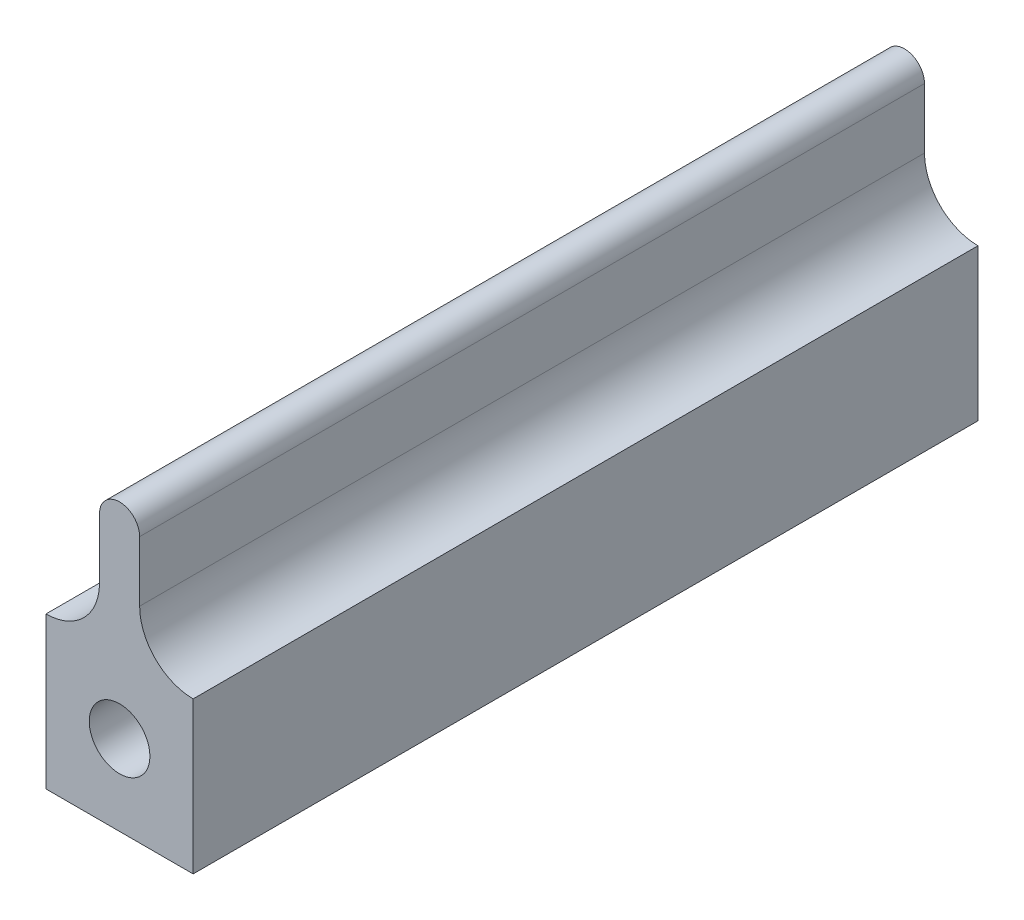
from build123d import *

# Parameters (mm, degrees)
BASE_EXTRUSION_DEPTH       = 88
TROU_TARAUD_M8X1_251_D     = 6.8
TROU_TARAUD_M8X1_251_DEPTH = 30
TROU_TARAUD_M8X1_251_TIP   = 2.042926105


with BuildPart() as part:
    # Esquisse1 → Base-Extrusion (new body)
    with BuildSketch(Plane.XY):
        with BuildLine():
            Line((-135.75, -171.5), (-119.25, -171.5))
            Line((-119.25, -171.5), (-119.25, -154.5))
            ThreePointArc((-119.25, -154.5), (-123.492640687, -152.742640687), (-125.25, -148.5))
            Line((-125.25, -148.5), (-125.25, -141.75))
            ThreePointArc((-125.25, -141.75), (-127.5, -139.5), (-129.75, -141.75))
            Line((-129.75, -141.75), (-129.75, -148.5))
            ThreePointArc((-129.75, -148.5), (-131.507359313, -152.742640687), (-135.75, -154.5))
            Line((-135.75, -154.5), (-135.75, -171.5))
        make_face()
    extrude(amount=-BASE_EXTRUSION_DEPTH)

    # Trou taraud_ M8x1.251
    with Locations(Plane.XY):
        with Locations((-127.5, -162.5)):
            Hole(TROU_TARAUD_M8X1_251_D / 2, depth=TROU_TARAUD_M8X1_251_DEPTH)
            with Locations((0, 0, -(TROU_TARAUD_M8X1_251_DEPTH + TROU_TARAUD_M8X1_251_TIP / 2))):  # 118° drill point
                Cone(0, TROU_TARAUD_M8X1_251_D / 2, TROU_TARAUD_M8X1_251_TIP, mode=Mode.SUBTRACT)


solid = part.part
